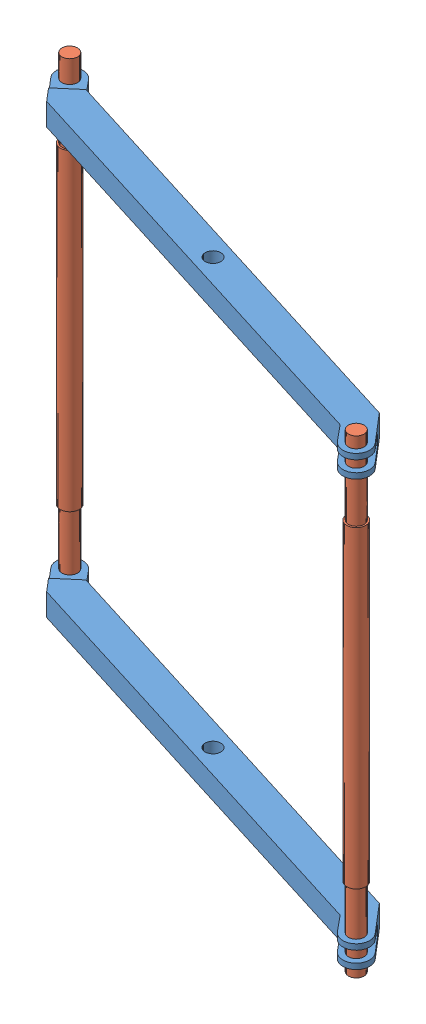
SolidWorks assembly layer_5.SLDASM, configuration Default (file format 11000). Lengths in mm.
Overall size (2311.11 2125 945.79).
4 component instances, 2 part files, 4 mates.
Components (placement in the parent):
- crossarm-1: crossarm.SLDPRT [Default] at (151.3438 950 2175.6762) x (0 -1 0) z (-0.954527 0 -0.298125) size (100 260 2340)
- crossarm-2: crossarm.SLDPRT [Default] at (151.3438 -950 2175.6762) x (0 -1 0) z (-0.954527 0 -0.298125) size (100 260 2340)
- cross_rod-1: cross_rod.SLDPRT [Default] at (1190 0 2573.4115) x (1 0 0) z (0 -1 0) size (85 85 2100)
- cross_rod-2: cross_rod.SLDPRT [Default] at (-887.3124 25 1777.941) x (1 0 0) z (0 1 0) size (85 85 2100)
Mates (geometry in assembly coordinates):
- Concentric1: concentric: cylinder of assembly; cylinder of assembly; cylinder of crossarm-2 through (-887.3124 -975 1777.941) axis (0 1 0) radius 35; cylinder of cross_rod-2 through (-887.3124 1075 1777.941) axis (0 -1 0) radius 35
- Distance1: distance = 50 mm: plane of assembly; plane of assembly; plane of crossarm-2 through (-887.3124 -975 1777.941) normal (0 -1 0); plane of cross_rod-2 through (-887.3124 -1025 1777.941) normal (0 -1 0)
- Concentric2: concentric: cylinder of assembly; cylinder of assembly; cylinder of crossarm-2 through (1190 -900 2573.4115) axis (0 -1 0) radius 35; cylinder of cross_rod-1 through (1190 -1050 2573.4115) axis (0 1 0) radius 35
- Distance2: distance = 50 mm: plane of assembly; plane of assembly; plane of crossarm-2 through (-824.0519 -1000 1944.3685) normal (0 -1 0); plane of cross_rod-1 through (1190 -1050 2573.4115) normal (0 -1 0)
